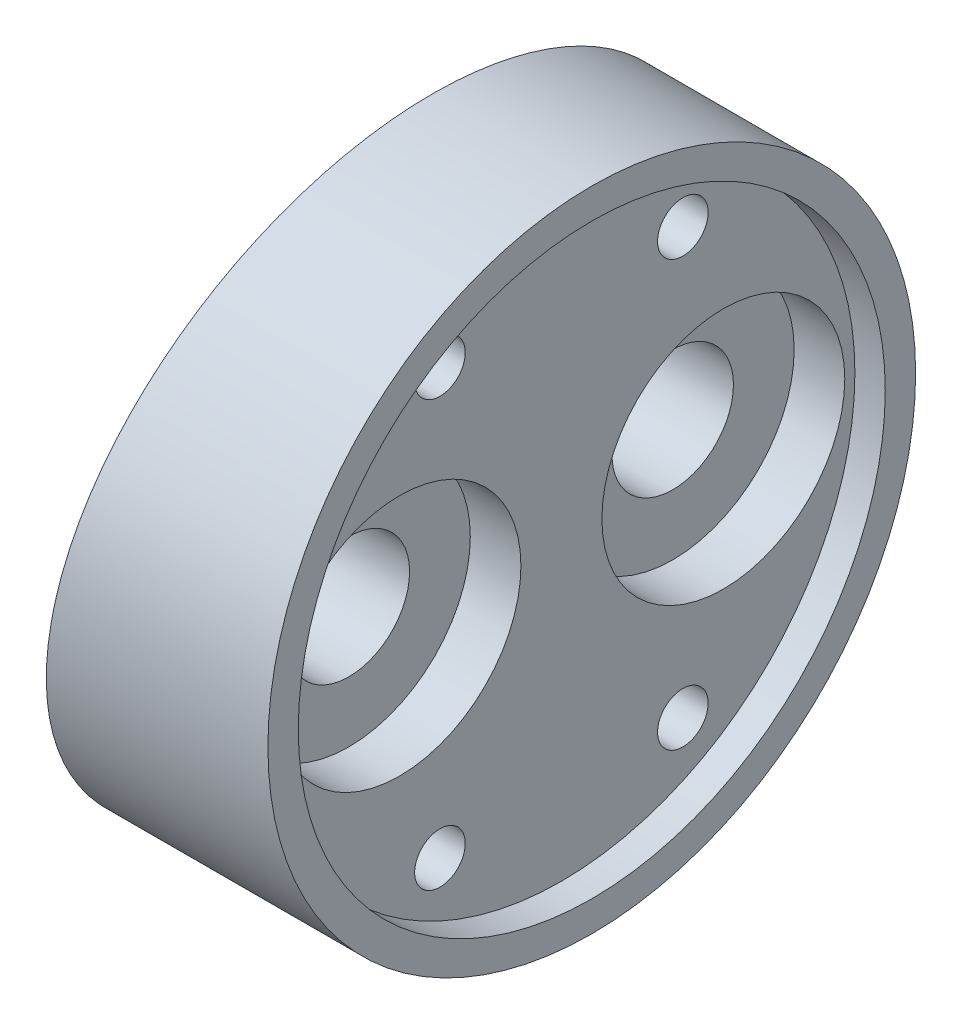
from build123d import *

# Parameters (mm, degrees)
SKIZZE1_W                          = 13.82
SKIZZE1_H                          = 16
SCHNITT_LINEAR_AUSTRAGEN1_DEPTH    = 50
F_6_0_6_DURCHMESSER_BOHRUNG1_D     = 6
F_6_0_6_DURCHMESSER_BOHRUNG1_DEPTH = 8.8
F_6_0_6_DURCHMESSER_BOHRUNG1_TIP   = 1.732050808
F_0_15_0_15_DURCHMESSER_BOHRUNG1_D = 0.15
SKIZZE9_R                          = 14.5
SCHNITT_LINEAR_AUSTRAGEN4_DEPTH    = 1.5
M3_GEWINDEBOHRUNG1_D               = 2.5
M3_GEWINDEBOHRUNG1_DEPTH           = 6
M3_GEWINDEBOHRUNG1_TIP             = 0.751075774
SKIZZE7_R                          = 6
SCHNITT_LINEAR_AUSTRAGEN2_DEPTH    = 4


with BuildPart() as part:
    # Skizze1 → Rotation1 (revolve)
    with BuildSketch(Plane.XY, mode=Mode.PRIVATE) as rotation1_sk:
        with Locations((3.79, 8)):
            Rectangle(SKIZZE1_W, SKIZZE1_H)
    revolve(rotation1_sk.sketch.rotate(Axis((-200068.176472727, 0, 0), (1, 0, 0)), 90), axis=Axis((-200068.176472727, 0, 0), (1, 0, 0)))

    # Skizze2 → Schnitt-Linear austragen1 (cut, symmetric)
    with BuildSketch(Plane.XY):
        Polygon((-2.821231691, -16), (2.821231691, 16), (-3.12, 16), (-3.12, -16), align=None)
    extrude(amount=SCHNITT_LINEAR_AUSTRAGEN1_DEPTH, both=True, mode=Mode.SUBTRACT)

    # 6.0 _6_ Durchmesser Bohrung1
    with Locations(Plane(origin=(10.7, 0, 0), x_dir=(0, 0, -1), z_dir=(1, 0, 0))):
        with Locations((8, 0), (-8, 0)):
            Hole(F_6_0_6_DURCHMESSER_BOHRUNG1_D / 2, depth=F_6_0_6_DURCHMESSER_BOHRUNG1_DEPTH)
            with Locations((0, 0, -(F_6_0_6_DURCHMESSER_BOHRUNG1_DEPTH + F_6_0_6_DURCHMESSER_BOHRUNG1_TIP / 2))):  # 120° drill point
                Cone(0, F_6_0_6_DURCHMESSER_BOHRUNG1_D / 2, F_6_0_6_DURCHMESSER_BOHRUNG1_TIP, mode=Mode.SUBTRACT)

    # 0.15 _0.15_ Durchmesser Bohrung1 (through all)
    with Locations(Plane(origin=(10.7, 0, 0), x_dir=(0, 0, -1), z_dir=(1, 0, 0))):
        with Locations((8, 0), (-8, 0)):
            Hole(F_0_15_0_15_DURCHMESSER_BOHRUNG1_D / 2)

    # Skizze9 → Schnitt-Linear austragen4 (cut)
    with BuildSketch(Plane(origin=(10.7, 0, 0), x_dir=(0, 0, -1), z_dir=(1, 0, 0))):
        Circle(SKIZZE9_R)
    extrude(amount=-SCHNITT_LINEAR_AUSTRAGEN4_DEPTH, mode=Mode.SUBTRACT)

    # M3 Gewindebohrung1
    with Locations(Plane(origin=(9.2, 0, 0), x_dir=(0, 0, -1), z_dir=(1, 0, 0))):
        with Locations((6, 10.5), (-6, 10.5), (-6, -10.5), (6, -10.5)):
            Hole(M3_GEWINDEBOHRUNG1_D / 2, depth=M3_GEWINDEBOHRUNG1_DEPTH)
            with Locations((0, 0, -(M3_GEWINDEBOHRUNG1_DEPTH + M3_GEWINDEBOHRUNG1_TIP / 2))):  # 118° drill point
                Cone(0, M3_GEWINDEBOHRUNG1_D / 2, M3_GEWINDEBOHRUNG1_TIP, mode=Mode.SUBTRACT)

    # Skizze7 → Schnitt-Linear austragen2 (cut)
    with BuildSketch(Plane(origin=(10.7, 0, 0), x_dir=(0, 0, -1), z_dir=(1, 0, 0))):
        with Locations((-8, 0)):
            Circle(SKIZZE7_R)
        with Locations((8, 0)):
            Circle(SKIZZE7_R)
    extrude(amount=-SCHNITT_LINEAR_AUSTRAGEN2_DEPTH, mode=Mode.SUBTRACT)


solid = part.part
